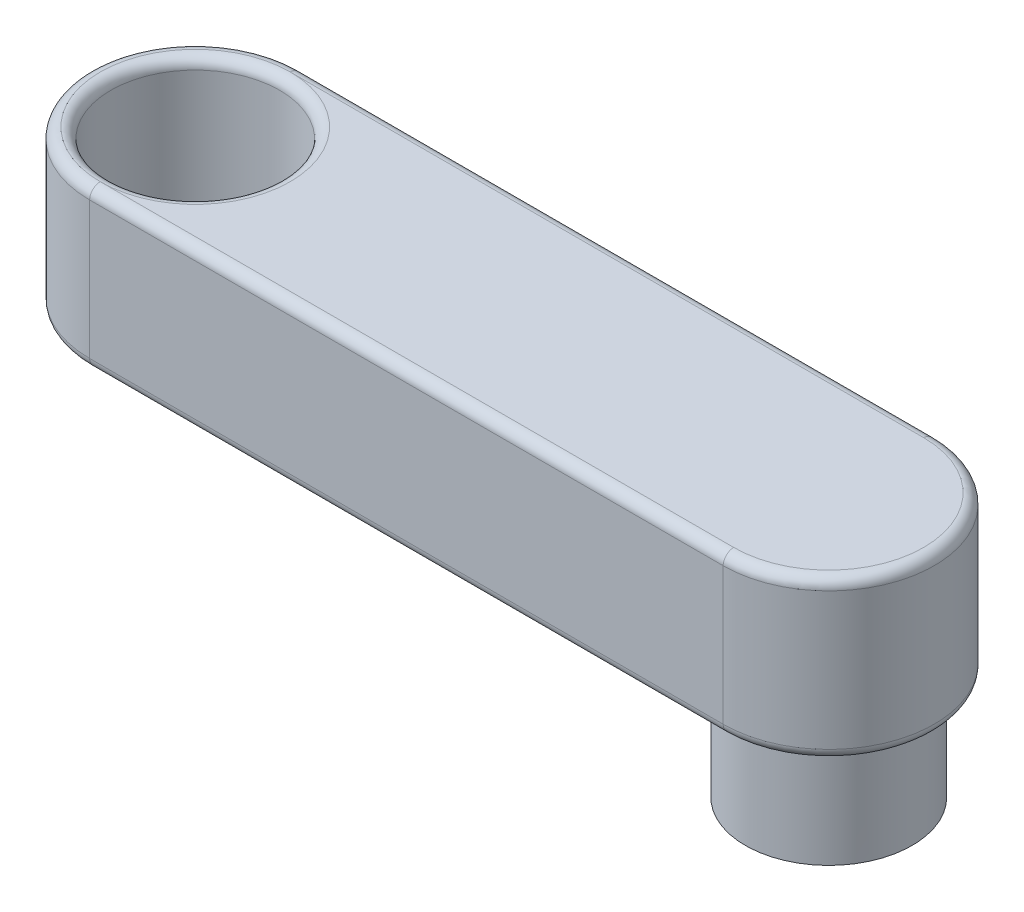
ISO-10303-21;
HEADER;
FILE_DESCRIPTION(('STEP AP214'),'2;1');
FILE_NAME('part.step','',(''),(''),'','','');
FILE_SCHEMA(('AUTOMOTIVE_DESIGN { 1 0 10303 214 1 1 1 1 }'));
ENDSEC;
DATA;
#1=APPLICATION_CONTEXT('core data for automotive mechanical design processes');
#2=APPLICATION_PROTOCOL_DEFINITION('international standard','automotive_design',2000,#1);
#3=PRODUCT_CONTEXT('',#1,'mechanical');
#4=PRODUCT('Part','Part','',(#3));
#5=PRODUCT_RELATED_PRODUCT_CATEGORY('part','',(#4));
#6=PRODUCT_DEFINITION_FORMATION('','',#4);
#7=PRODUCT_DEFINITION_CONTEXT('part definition',#1,'design');
#8=PRODUCT_DEFINITION('design','',#6,#7);
#9=PRODUCT_DEFINITION_SHAPE('','',#8);
#10=(LENGTH_UNIT() NAMED_UNIT(*) SI_UNIT(.MILLI.,.METRE.));
#11=(NAMED_UNIT(*) PLANE_ANGLE_UNIT() SI_UNIT($,.RADIAN.));
#12=(NAMED_UNIT(*) SI_UNIT($,.STERADIAN.) SOLID_ANGLE_UNIT());
#13=UNCERTAINTY_MEASURE_WITH_UNIT(LENGTH_MEASURE(1.E-05),#10,'distance_accuracy_value','');
#14=(GEOMETRIC_REPRESENTATION_CONTEXT(3) GLOBAL_UNCERTAINTY_ASSIGNED_CONTEXT((#13)) GLOBAL_UNIT_ASSIGNED_CONTEXT((#10,
#11,#12)) REPRESENTATION_CONTEXT('',''));
#15=CARTESIAN_POINT('',(0.,0.,0.));
#16=DIRECTION('',(0.,0.,1.));
#17=DIRECTION('',(1.,0.,0.));
#18=AXIS2_PLACEMENT_3D('',#15,#16,#17);
#19=CARTESIAN_POINT('',(-14.7809987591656,-95.551951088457,125.));
#20=DIRECTION('',(0.,1.,0.));
#21=DIRECTION('',(-1.,0.,0.));
#22=AXIS2_PLACEMENT_3D('',#19,#20,#21);
#23=CYLINDRICAL_SURFACE('',#22,50.);
#24=DIRECTION('',(0.,1.,0.));
#25=VECTOR('',#24,1.);
#26=CARTESIAN_POINT('',(-14.7809987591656,-95.5519510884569,75.0000000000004));
#27=LINE('',#26,#25);
#28=CARTESIAN_POINT('',(-14.7809987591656,-90.5519510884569,75.0000000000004));
#29=VERTEX_POINT('',#28);
#30=CARTESIAN_POINT('',(-14.7809987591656,-25.551951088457,75.0000000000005));
#31=VERTEX_POINT('',#30);
#32=EDGE_CURVE('E120',#29,#31,#27,.T.);
#33=ORIENTED_EDGE('',*,*,#32,.F.);
#34=CARTESIAN_POINT('',(-14.7809987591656,-90.551951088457,125.));
#35=DIRECTION('',(0.,-1.,0.));
#36=DIRECTION('',(0.,0.,-1.));
#37=AXIS2_PLACEMENT_3D('',#34,#35,#36);
#38=CIRCLE('',#37,50.);
#39=CARTESIAN_POINT('',(-14.7809987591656,-90.5519510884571,175.));
#40=VERTEX_POINT('',#39);
#41=EDGE_CURVE('E216',#29,#40,#38,.F.);
#42=ORIENTED_EDGE('',*,*,#41,.T.);
#43=DIRECTION('',(0.,1.,0.));
#44=VECTOR('',#43,1.);
#45=CARTESIAN_POINT('',(-14.7809987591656,-95.5519510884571,175.));
#46=LINE('',#45,#44);
#47=CARTESIAN_POINT('',(-14.7809987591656,-25.5519510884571,175.000000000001));
#48=VERTEX_POINT('',#47);
#49=EDGE_CURVE('E253',#40,#48,#46,.T.);
#50=ORIENTED_EDGE('',*,*,#49,.T.);
#51=CARTESIAN_POINT('',(-14.7809987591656,-25.551951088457,125.000000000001));
#52=DIRECTION('',(0.,-1.,0.));
#53=DIRECTION('',(0.,0.,-1.));
#54=AXIS2_PLACEMENT_3D('',#51,#52,#53);
#55=CIRCLE('',#54,50.);
#56=EDGE_CURVE('E168',#48,#31,#55,.T.);
#57=ORIENTED_EDGE('',*,*,#56,.T.);
#58=EDGE_LOOP('',(#33,#42,#50,#57));
#59=FACE_BOUND('',#58,.T.);
#60=ADVANCED_FACE('F39',(#59),#23,.T.);
#61=CARTESIAN_POINT('',(-14.7809987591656,-95.5519510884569,75.0000000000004));
#62=DIRECTION('',(0.,0.,1.));
#63=DIRECTION('',(0.,-1.,0.));
#64=AXIS2_PLACEMENT_3D('',#61,#62,#63);
#65=PLANE('',#64);
#66=DIRECTION('',(0.,1.,0.));
#67=VECTOR('',#66,1.);
#68=CARTESIAN_POINT('',(285.219001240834,-95.5519510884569,75.0000000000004));
#69=LINE('',#68,#67);
#70=CARTESIAN_POINT('',(285.219001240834,-90.5519510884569,75.0000000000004));
#71=VERTEX_POINT('',#70);
#72=CARTESIAN_POINT('',(285.219001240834,-25.551951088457,75.0000000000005));
#73=VERTEX_POINT('',#72);
#74=EDGE_CURVE('E112',#71,#73,#69,.T.);
#75=ORIENTED_EDGE('',*,*,#74,.F.);
#76=DIRECTION('',(1.,0.,0.));
#77=VECTOR('',#76,1.);
#78=CARTESIAN_POINT('',(-14.7809987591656,-90.5519510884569,75.0000000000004));
#79=LINE('',#78,#77);
#80=EDGE_CURVE('E57',#71,#29,#79,.F.);
#81=ORIENTED_EDGE('',*,*,#80,.T.);
#82=ORIENTED_EDGE('',*,*,#32,.T.);
#83=DIRECTION('',(1.,0.,0.));
#84=VECTOR('',#83,1.);
#85=CARTESIAN_POINT('',(-14.7809987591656,-25.5519510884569,75.0000000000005));
#86=LINE('',#85,#84);
#87=EDGE_CURVE('E129',#31,#73,#86,.T.);
#88=ORIENTED_EDGE('',*,*,#87,.T.);
#89=EDGE_LOOP('',(#75,#81,#82,#88));
#90=FACE_BOUND('',#89,.T.);
#91=ADVANCED_FACE('F144',(#90),#65,.F.);
#92=CARTESIAN_POINT('',(285.219001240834,-95.551951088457,125.));
#93=DIRECTION('',(0.,1.,0.));
#94=DIRECTION('',(-1.,0.,0.));
#95=AXIS2_PLACEMENT_3D('',#92,#93,#94);
#96=CYLINDRICAL_SURFACE('',#95,50.);
#97=DIRECTION('',(0.,1.,0.));
#98=VECTOR('',#97,1.);
#99=CARTESIAN_POINT('',(285.219001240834,-95.5519510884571,175.));
#100=LINE('',#99,#98);
#101=CARTESIAN_POINT('',(285.219001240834,-90.5519510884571,175.));
#102=VERTEX_POINT('',#101);
#103=CARTESIAN_POINT('',(285.219001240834,-25.5519510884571,175.000000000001));
#104=VERTEX_POINT('',#103);
#105=EDGE_CURVE('E121',#102,#104,#100,.T.);
#106=ORIENTED_EDGE('',*,*,#105,.F.);
#107=CARTESIAN_POINT('',(285.219001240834,-90.551951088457,125.));
#108=DIRECTION('',(0.,-1.,0.));
#109=DIRECTION('',(0.,0.,-1.));
#110=AXIS2_PLACEMENT_3D('',#107,#108,#109);
#111=CIRCLE('',#110,50.);
#112=EDGE_CURVE('E65',#102,#71,#111,.F.);
#113=ORIENTED_EDGE('',*,*,#112,.T.);
#114=ORIENTED_EDGE('',*,*,#74,.T.);
#115=CARTESIAN_POINT('',(285.219001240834,-25.551951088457,125.000000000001));
#116=DIRECTION('',(0.,-1.,0.));
#117=DIRECTION('',(0.,0.,-1.));
#118=AXIS2_PLACEMENT_3D('',#115,#116,#117);
#119=CIRCLE('',#118,50.);
#120=EDGE_CURVE('E116',#73,#104,#119,.T.);
#121=ORIENTED_EDGE('',*,*,#120,.T.);
#122=EDGE_LOOP('',(#106,#113,#114,#121));
#123=FACE_BOUND('',#122,.T.);
#124=ADVANCED_FACE('F114',(#123),#96,.T.);
#125=CARTESIAN_POINT('',(-14.7809987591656,-95.5519510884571,175.));
#126=DIRECTION('',(0.,0.,-1.));
#127=DIRECTION('',(0.,1.,0.));
#128=AXIS2_PLACEMENT_3D('',#125,#126,#127);
#129=PLANE('',#128);
#130=ORIENTED_EDGE('',*,*,#49,.F.);
#131=DIRECTION('',(-1.,0.,0.));
#132=VECTOR('',#131,1.);
#133=CARTESIAN_POINT('',(285.219001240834,-90.5519510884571,175.));
#134=LINE('',#133,#132);
#135=EDGE_CURVE('E208',#40,#102,#134,.F.);
#136=ORIENTED_EDGE('',*,*,#135,.T.);
#137=ORIENTED_EDGE('',*,*,#105,.T.);
#138=DIRECTION('',(-1.,0.,0.));
#139=VECTOR('',#138,1.);
#140=CARTESIAN_POINT('',(-14.7809987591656,-25.5519510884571,175.000000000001));
#141=LINE('',#140,#139);
#142=EDGE_CURVE('E142',#104,#48,#141,.T.);
#143=ORIENTED_EDGE('',*,*,#142,.T.);
#144=EDGE_LOOP('',(#130,#136,#137,#143));
#145=FACE_BOUND('',#144,.T.);
#146=ADVANCED_FACE('F256',(#145),#129,.F.);
#147=CARTESIAN_POINT('',(-14.7809987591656,-95.551951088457,125.));
#148=DIRECTION('',(0.,-1.,0.));
#149=DIRECTION('',(1.,0.,0.));
#150=AXIS2_PLACEMENT_3D('',#147,#148,#149);
#151=PLANE('',#150);
#152=CARTESIAN_POINT('',(285.219001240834,-95.551951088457,125.));
#153=DIRECTION('',(0.,-1.,0.));
#154=DIRECTION('',(0.,0.,-1.));
#155=AXIS2_PLACEMENT_3D('',#152,#153,#154);
#156=CIRCLE('',#155,45.);
#157=CARTESIAN_POINT('',(285.219001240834,-95.5519510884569,80.0000000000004));
#158=VERTEX_POINT('',#157);
#159=CARTESIAN_POINT('',(285.219001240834,-95.5519510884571,170.));
#160=VERTEX_POINT('',#159);
#161=EDGE_CURVE('E201',#158,#160,#156,.T.);
#162=ORIENTED_EDGE('',*,*,#161,.T.);
#163=DIRECTION('',(-1.,0.,0.));
#164=VECTOR('',#163,1.);
#165=CARTESIAN_POINT('',(-14.7809987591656,-95.5519510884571,170.));
#166=LINE('',#165,#164);
#167=CARTESIAN_POINT('',(-14.7809987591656,-95.5519510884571,170.));
#168=VERTEX_POINT('',#167);
#169=EDGE_CURVE('E204',#160,#168,#166,.T.);
#170=ORIENTED_EDGE('',*,*,#169,.T.);
#171=CARTESIAN_POINT('',(-14.7809987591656,-95.551951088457,125.));
#172=DIRECTION('',(0.,-1.,0.));
#173=DIRECTION('',(0.,0.,-1.));
#174=AXIS2_PLACEMENT_3D('',#171,#172,#173);
#175=CIRCLE('',#174,45.);
#176=CARTESIAN_POINT('',(30.2190012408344,-95.551951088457,125.));
#177=VERTEX_POINT('',#176);
#178=EDGE_CURVE('E192',#168,#177,#175,.F.);
#179=ORIENTED_EDGE('',*,*,#178,.T.);
#180=CARTESIAN_POINT('',(-14.7809987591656,-95.551951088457,125.));
#181=DIRECTION('',(0.,-1.,0.));
#182=DIRECTION('',(0.,0.,-1.));
#183=AXIS2_PLACEMENT_3D('',#180,#181,#182);
#184=CIRCLE('',#183,45.);
#185=CARTESIAN_POINT('',(-14.7809987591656,-95.5519510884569,80.0000000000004));
#186=VERTEX_POINT('',#185);
#187=EDGE_CURVE('E195',#177,#186,#184,.F.);
#188=ORIENTED_EDGE('',*,*,#187,.T.);
#189=DIRECTION('',(1.,0.,0.));
#190=VECTOR('',#189,1.);
#191=CARTESIAN_POINT('',(285.219001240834,-95.5519510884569,80.0000000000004));
#192=LINE('',#191,#190);
#193=EDGE_CURVE('E198',#186,#158,#192,.T.);
#194=ORIENTED_EDGE('',*,*,#193,.T.);
#195=EDGE_LOOP('',(#162,#170,#179,#188,#194));
#196=FACE_BOUND('',#195,.T.);
#197=CARTESIAN_POINT('',(285.219001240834,-95.551951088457,125.));
#198=DIRECTION('',(0.,-1.,0.));
#199=DIRECTION('',(0.,0.,-1.));
#200=AXIS2_PLACEMENT_3D('',#197,#198,#199);
#201=CIRCLE('',#200,44.5);
#202=CARTESIAN_POINT('',(285.219001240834,-95.5519510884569,80.5000000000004));
#203=VERTEX_POINT('',#202);
#204=EDGE_CURVE('E174',#203,#203,#201,.F.);
#205=ORIENTED_EDGE('',*,*,#204,.T.);
#206=EDGE_LOOP('',(#205));
#207=FACE_BOUND('',#206,.T.);
#208=ADVANCED_FACE('F264',(#196,#207),#151,.T.);
#209=CARTESIAN_POINT('',(-14.7809987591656,-20.551951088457,125.000000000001));
#210=DIRECTION('',(0.,-1.,0.));
#211=DIRECTION('',(1.,0.,0.));
#212=AXIS2_PLACEMENT_3D('',#209,#210,#211);
#213=PLANE('',#212);
#214=CARTESIAN_POINT('',(285.219001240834,-20.551951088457,125.000000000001));
#215=DIRECTION('',(0.,-1.,0.));
#216=DIRECTION('',(0.,0.,-1.));
#217=AXIS2_PLACEMENT_3D('',#214,#215,#216);
#218=CIRCLE('',#217,45.);
#219=CARTESIAN_POINT('',(285.219001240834,-20.5519510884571,170.000000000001));
#220=VERTEX_POINT('',#219);
#221=CARTESIAN_POINT('',(285.219001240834,-20.5519510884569,80.0000000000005));
#222=VERTEX_POINT('',#221);
#223=EDGE_CURVE('E160',#220,#222,#218,.F.);
#224=ORIENTED_EDGE('',*,*,#223,.T.);
#225=DIRECTION('',(1.,0.,0.));
#226=VECTOR('',#225,1.);
#227=CARTESIAN_POINT('',(-14.7809987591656,-20.5519510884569,80.0000000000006));
#228=LINE('',#227,#226);
#229=CARTESIAN_POINT('',(-14.7809987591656,-20.5519510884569,80.0000000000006));
#230=VERTEX_POINT('',#229);
#231=EDGE_CURVE('E131',#222,#230,#228,.F.);
#232=ORIENTED_EDGE('',*,*,#231,.T.);
#233=CARTESIAN_POINT('',(-14.7809987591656,-20.551951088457,125.000000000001));
#234=DIRECTION('',(0.,-1.,0.));
#235=DIRECTION('',(0.,0.,-1.));
#236=AXIS2_PLACEMENT_3D('',#233,#234,#235);
#237=CIRCLE('',#236,45.);
#238=CARTESIAN_POINT('',(30.2190012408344,-20.551951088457,125.000000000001));
#239=VERTEX_POINT('',#238);
#240=EDGE_CURVE('E147',#230,#239,#237,.T.);
#241=ORIENTED_EDGE('',*,*,#240,.T.);
#242=CARTESIAN_POINT('',(-14.7809987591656,-20.551951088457,125.000000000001));
#243=DIRECTION('',(0.,-1.,0.));
#244=DIRECTION('',(0.,0.,-1.));
#245=AXIS2_PLACEMENT_3D('',#242,#243,#244);
#246=CIRCLE('',#245,45.);
#247=CARTESIAN_POINT('',(-14.7809987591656,-20.5519510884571,170.000000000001));
#248=VERTEX_POINT('',#247);
#249=EDGE_CURVE('E151',#239,#248,#246,.T.);
#250=ORIENTED_EDGE('',*,*,#249,.T.);
#251=DIRECTION('',(-1.,0.,0.));
#252=VECTOR('',#251,1.);
#253=CARTESIAN_POINT('',(-14.7809987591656,-20.5519510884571,170.000000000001));
#254=LINE('',#253,#252);
#255=EDGE_CURVE('E157',#248,#220,#254,.F.);
#256=ORIENTED_EDGE('',*,*,#255,.T.);
#257=EDGE_LOOP('',(#224,#232,#241,#250,#256));
#258=FACE_BOUND('',#257,.T.);
#259=ADVANCED_FACE('F402',(#258),#213,.F.);
#260=CARTESIAN_POINT('',(-14.7809987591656,-120.551951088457,125.));
#261=DIRECTION('',(0.,1.,0.));
#262=DIRECTION('',(-1.,0.,0.));
#263=AXIS2_PLACEMENT_3D('',#260,#261,#262);
#264=CYLINDRICAL_SURFACE('',#263,40.);
#265=CARTESIAN_POINT('',(-14.7809987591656,-90.551951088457,125.));
#266=DIRECTION('',(0.,-1.,0.));
#267=DIRECTION('',(0.,0.,-1.));
#268=AXIS2_PLACEMENT_3D('',#265,#266,#267);
#269=CIRCLE('',#268,40.);
#270=CARTESIAN_POINT('',(-54.7809987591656,-90.551951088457,125.));
#271=VERTEX_POINT('',#270);
#272=EDGE_CURVE('E49',#271,#271,#269,.T.);
#273=CARTESIAN_POINT('',(-14.7809987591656,-25.551951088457,125.000000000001));
#274=DIRECTION('',(0.,-1.,0.));
#275=DIRECTION('',(0.,0.,-1.));
#276=AXIS2_PLACEMENT_3D('',#273,#274,#275);
#277=CIRCLE('',#276,40.);
#278=CARTESIAN_POINT('',(-54.7809987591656,-25.551951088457,125.000000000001));
#279=VERTEX_POINT('',#278);
#280=EDGE_CURVE('E171',#279,#279,#277,.F.);
#281=CARTESIAN_POINT('',(-54.7809987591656,-90.551951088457,125.));
#282=CARTESIAN_POINT('',(-54.7809987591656,-89.8748677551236,125.));
#283=CARTESIAN_POINT('',(-54.7809987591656,-89.1977844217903,125.));
#284=CARTESIAN_POINT('',(-54.7809987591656,-87.8436177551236,125.));
#285=CARTESIAN_POINT('',(-54.7809987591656,-87.1665344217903,125.));
#286=CARTESIAN_POINT('',(-54.7809987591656,-85.8123677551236,125.));
#287=CARTESIAN_POINT('',(-54.7809987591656,-85.1352844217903,125.));
#288=CARTESIAN_POINT('',(-54.7809987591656,-83.7811177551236,125.));
#289=CARTESIAN_POINT('',(-54.7809987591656,-83.1040344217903,125.));
#290=CARTESIAN_POINT('',(-54.7809987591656,-81.7498677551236,125.));
#291=CARTESIAN_POINT('',(-54.7809987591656,-81.0727844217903,125.));
#292=CARTESIAN_POINT('',(-54.7809987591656,-79.7186177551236,125.));
#293=CARTESIAN_POINT('',(-54.7809987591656,-79.0415344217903,125.));
#294=CARTESIAN_POINT('',(-54.7809987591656,-77.6873677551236,125.));
#295=CARTESIAN_POINT('',(-54.7809987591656,-77.0102844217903,125.));
#296=CARTESIAN_POINT('',(-54.7809987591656,-75.6561177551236,125.));
#297=CARTESIAN_POINT('',(-54.7809987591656,-74.9790344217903,125.));
#298=CARTESIAN_POINT('',(-54.7809987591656,-73.6248677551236,125.));
#299=CARTESIAN_POINT('',(-54.7809987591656,-72.9477844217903,125.));
#300=CARTESIAN_POINT('',(-54.7809987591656,-71.5936177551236,125.));
#301=CARTESIAN_POINT('',(-54.7809987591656,-70.9165344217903,125.));
#302=CARTESIAN_POINT('',(-54.7809987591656,-69.5623677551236,125.));
#303=CARTESIAN_POINT('',(-54.7809987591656,-68.8852844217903,125.));
#304=CARTESIAN_POINT('',(-54.7809987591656,-67.5311177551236,125.));
#305=CARTESIAN_POINT('',(-54.7809987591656,-66.8540344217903,125.));
#306=CARTESIAN_POINT('',(-54.7809987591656,-65.4998677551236,125.));
#307=CARTESIAN_POINT('',(-54.7809987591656,-64.8227844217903,125.));
#308=CARTESIAN_POINT('',(-54.7809987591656,-63.4686177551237,125.));
#309=CARTESIAN_POINT('',(-54.7809987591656,-62.7915344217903,125.));
#310=CARTESIAN_POINT('',(-54.7809987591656,-61.4373677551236,125.));
#311=CARTESIAN_POINT('',(-54.7809987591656,-60.7602844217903,125.));
#312=CARTESIAN_POINT('',(-54.7809987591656,-59.4061177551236,125.));
#313=CARTESIAN_POINT('',(-54.7809987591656,-58.7290344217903,125.));
#314=CARTESIAN_POINT('',(-54.7809987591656,-57.3748677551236,125.));
#315=CARTESIAN_POINT('',(-54.7809987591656,-56.6977844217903,125.));
#316=CARTESIAN_POINT('',(-54.7809987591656,-55.3436177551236,125.));
#317=CARTESIAN_POINT('',(-54.7809987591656,-54.6665344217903,125.));
#318=CARTESIAN_POINT('',(-54.7809987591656,-53.3123677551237,125.));
#319=CARTESIAN_POINT('',(-54.7809987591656,-52.6352844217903,125.));
#320=CARTESIAN_POINT('',(-54.7809987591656,-51.2811177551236,125.));
#321=CARTESIAN_POINT('',(-54.7809987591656,-50.6040344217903,125.));
#322=CARTESIAN_POINT('',(-54.7809987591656,-49.2498677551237,125.));
#323=CARTESIAN_POINT('',(-54.7809987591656,-48.5727844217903,125.));
#324=CARTESIAN_POINT('',(-54.7809987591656,-47.2186177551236,125.));
#325=CARTESIAN_POINT('',(-54.7809987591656,-46.5415344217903,125.));
#326=CARTESIAN_POINT('',(-54.7809987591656,-45.1873677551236,125.));
#327=CARTESIAN_POINT('',(-54.7809987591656,-44.5102844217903,125.000000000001));
#328=CARTESIAN_POINT('',(-54.7809987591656,-43.1561177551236,125.000000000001));
#329=CARTESIAN_POINT('',(-54.7809987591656,-42.4790344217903,125.000000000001));
#330=CARTESIAN_POINT('',(-54.7809987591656,-41.1248677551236,125.000000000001));
#331=CARTESIAN_POINT('',(-54.7809987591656,-40.4477844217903,125.000000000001));
#332=CARTESIAN_POINT('',(-54.7809987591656,-39.0936177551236,125.000000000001));
#333=CARTESIAN_POINT('',(-54.7809987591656,-38.4165344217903,125.000000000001));
#334=CARTESIAN_POINT('',(-54.7809987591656,-37.0623677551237,125.000000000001));
#335=CARTESIAN_POINT('',(-54.7809987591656,-36.3852844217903,125.000000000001));
#336=CARTESIAN_POINT('',(-54.7809987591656,-35.0311177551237,125.000000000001));
#337=CARTESIAN_POINT('',(-54.7809987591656,-34.3540344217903,125.000000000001));
#338=CARTESIAN_POINT('',(-54.7809987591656,-32.9998677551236,125.000000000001));
#339=CARTESIAN_POINT('',(-54.7809987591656,-32.3227844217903,125.000000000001));
#340=CARTESIAN_POINT('',(-54.7809987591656,-30.9686177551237,125.000000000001));
#341=CARTESIAN_POINT('',(-54.7809987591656,-30.2915344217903,125.000000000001));
#342=CARTESIAN_POINT('',(-54.7809987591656,-28.9373677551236,125.000000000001));
#343=CARTESIAN_POINT('',(-54.7809987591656,-28.2602844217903,125.000000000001));
#344=CARTESIAN_POINT('',(-54.7809987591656,-26.9061177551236,125.000000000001));
#345=CARTESIAN_POINT('',(-54.7809987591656,-26.2290344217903,125.000000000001));
#346=CARTESIAN_POINT('',(-54.7809987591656,-25.551951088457,125.000000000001));
#347=B_SPLINE_CURVE_WITH_KNOTS('',3,(#281,#282,#283,#284,#285,#286,#287,#288,#289,#290,#291,
#292,#293,#294,#295,#296,#297,#298,#299,#300,#301,#302,#303,#304,#305,#306,#307,#308,#309,#310,
#311,#312,#313,#314,#315,#316,#317,#318,#319,#320,#321,#322,#323,#324,#325,#326,#327,#328,#329,
#330,#331,#332,#333,#334,#335,#336,#337,#338,#339,#340,#341,#342,#343,#344,#345,#346),
.UNSPECIFIED.,.F.,.F.,(4,2,2,2,2,2,2,2,2,2,2,2,2,2,2,2,2,2,2,2,2,2,2,2,2,2,2,2,2,2,2,2,4),(0.,
2.03125,4.06249999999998,6.09374999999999,8.12499999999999,10.15625,12.1875,14.21875,16.25,
18.28125,20.3125,22.34375,24.375,26.40625,28.4375,30.46875,32.5,34.53125,36.5625,38.59375,
40.625,42.65625,44.6875,46.71875,48.75,50.78125,52.8125,54.84375,56.875,58.90625,60.9375,
62.96875,65.),.UNSPECIFIED.);
#348=EDGE_CURVE('BSEAM407',#271,#279,#347,.T.);
#349=ORIENTED_EDGE('',*,*,#272,.T.);
#350=ORIENTED_EDGE('',*,*,#280,.T.);
#351=ORIENTED_EDGE('',*,*,#348,.T.);
#352=ORIENTED_EDGE('',*,*,#348,.F.);
#353=EDGE_LOOP('',(#349,#351,#350,#352));
#354=FACE_BOUND('',#353,.T.);
#355=ADVANCED_FACE('F407',(#354),#264,.F.);
#356=CARTESIAN_POINT('',(285.219001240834,-145.551951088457,125.));
#357=DIRECTION('',(0.,1.,0.));
#358=DIRECTION('',(-1.,0.,0.));
#359=AXIS2_PLACEMENT_3D('',#356,#357,#358);
#360=CYLINDRICAL_SURFACE('',#359,39.5);
#361=CARTESIAN_POINT('',(285.219001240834,-100.551951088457,125.));
#362=DIRECTION('',(0.,-1.,0.));
#363=DIRECTION('',(0.,0.,-1.));
#364=AXIS2_PLACEMENT_3D('',#361,#362,#363);
#365=CIRCLE('',#364,39.5);
#366=CARTESIAN_POINT('',(245.719001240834,-100.551951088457,125.));
#367=VERTEX_POINT('',#366);
#368=EDGE_CURVE('E11',#367,#367,#365,.T.);
#369=CARTESIAN_POINT('',(285.219001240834,-145.551951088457,125.));
#370=DIRECTION('',(0.,-1.,0.));
#371=DIRECTION('',(1.,0.,0.));
#372=AXIS2_PLACEMENT_3D('',#369,#370,#371);
#373=CIRCLE('',#372,39.5);
#374=CARTESIAN_POINT('',(245.719001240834,-145.551951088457,125.));
#375=VERTEX_POINT('',#374);
#376=EDGE_CURVE('E188',#375,#375,#373,.T.);
#377=CARTESIAN_POINT('',(245.719001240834,-100.551951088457,125.));
#378=CARTESIAN_POINT('',(245.719001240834,-101.020701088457,125.));
#379=CARTESIAN_POINT('',(245.719001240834,-101.489451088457,125.));
#380=CARTESIAN_POINT('',(245.719001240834,-102.426951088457,125.));
#381=CARTESIAN_POINT('',(245.719001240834,-102.895701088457,125.));
#382=CARTESIAN_POINT('',(245.719001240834,-103.833201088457,125.));
#383=CARTESIAN_POINT('',(245.719001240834,-104.301951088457,125.));
#384=CARTESIAN_POINT('',(245.719001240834,-105.239451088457,125.));
#385=CARTESIAN_POINT('',(245.719001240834,-105.708201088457,125.));
#386=CARTESIAN_POINT('',(245.719001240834,-106.645701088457,125.));
#387=CARTESIAN_POINT('',(245.719001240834,-107.114451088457,125.));
#388=CARTESIAN_POINT('',(245.719001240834,-108.051951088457,125.));
#389=CARTESIAN_POINT('',(245.719001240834,-108.520701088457,125.));
#390=CARTESIAN_POINT('',(245.719001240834,-109.458201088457,125.));
#391=CARTESIAN_POINT('',(245.719001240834,-109.926951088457,125.));
#392=CARTESIAN_POINT('',(245.719001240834,-110.864451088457,125.));
#393=CARTESIAN_POINT('',(245.719001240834,-111.333201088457,125.));
#394=CARTESIAN_POINT('',(245.719001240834,-112.270701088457,125.));
#395=CARTESIAN_POINT('',(245.719001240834,-112.739451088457,125.));
#396=CARTESIAN_POINT('',(245.719001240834,-113.676951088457,125.));
#397=CARTESIAN_POINT('',(245.719001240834,-114.145701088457,125.));
#398=CARTESIAN_POINT('',(245.719001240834,-115.083201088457,125.));
#399=CARTESIAN_POINT('',(245.719001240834,-115.551951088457,125.));
#400=CARTESIAN_POINT('',(245.719001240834,-116.489451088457,125.));
#401=CARTESIAN_POINT('',(245.719001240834,-116.958201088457,125.));
#402=CARTESIAN_POINT('',(245.719001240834,-117.895701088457,125.));
#403=CARTESIAN_POINT('',(245.719001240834,-118.364451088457,125.));
#404=CARTESIAN_POINT('',(245.719001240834,-119.301951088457,125.));
#405=CARTESIAN_POINT('',(245.719001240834,-119.770701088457,125.));
#406=CARTESIAN_POINT('',(245.719001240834,-120.708201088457,125.));
#407=CARTESIAN_POINT('',(245.719001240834,-121.176951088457,125.));
#408=CARTESIAN_POINT('',(245.719001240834,-122.114451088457,125.));
#409=CARTESIAN_POINT('',(245.719001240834,-122.583201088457,125.));
#410=CARTESIAN_POINT('',(245.719001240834,-123.520701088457,125.));
#411=CARTESIAN_POINT('',(245.719001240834,-123.989451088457,125.));
#412=CARTESIAN_POINT('',(245.719001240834,-124.926951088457,125.));
#413=CARTESIAN_POINT('',(245.719001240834,-125.395701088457,125.));
#414=CARTESIAN_POINT('',(245.719001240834,-126.333201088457,125.));
#415=CARTESIAN_POINT('',(245.719001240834,-126.801951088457,125.));
#416=CARTESIAN_POINT('',(245.719001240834,-127.739451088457,125.));
#417=CARTESIAN_POINT('',(245.719001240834,-128.208201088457,125.));
#418=CARTESIAN_POINT('',(245.719001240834,-129.145701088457,125.));
#419=CARTESIAN_POINT('',(245.719001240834,-129.614451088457,125.));
#420=CARTESIAN_POINT('',(245.719001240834,-130.551951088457,125.));
#421=CARTESIAN_POINT('',(245.719001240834,-131.020701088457,125.));
#422=CARTESIAN_POINT('',(245.719001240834,-131.958201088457,125.));
#423=CARTESIAN_POINT('',(245.719001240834,-132.426951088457,125.));
#424=CARTESIAN_POINT('',(245.719001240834,-133.364451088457,125.));
#425=CARTESIAN_POINT('',(245.719001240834,-133.833201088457,125.));
#426=CARTESIAN_POINT('',(245.719001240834,-134.770701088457,125.));
#427=CARTESIAN_POINT('',(245.719001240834,-135.239451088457,125.));
#428=CARTESIAN_POINT('',(245.719001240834,-136.176951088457,125.));
#429=CARTESIAN_POINT('',(245.719001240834,-136.645701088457,125.));
#430=CARTESIAN_POINT('',(245.719001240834,-137.583201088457,125.));
#431=CARTESIAN_POINT('',(245.719001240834,-138.051951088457,125.));
#432=CARTESIAN_POINT('',(245.719001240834,-138.989451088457,125.));
#433=CARTESIAN_POINT('',(245.719001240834,-139.458201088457,125.));
#434=CARTESIAN_POINT('',(245.719001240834,-140.395701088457,125.));
#435=CARTESIAN_POINT('',(245.719001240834,-140.864451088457,125.));
#436=CARTESIAN_POINT('',(245.719001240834,-141.801951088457,125.));
#437=CARTESIAN_POINT('',(245.719001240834,-142.270701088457,125.));
#438=CARTESIAN_POINT('',(245.719001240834,-143.208201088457,125.));
#439=CARTESIAN_POINT('',(245.719001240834,-143.676951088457,125.));
#440=CARTESIAN_POINT('',(245.719001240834,-144.614451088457,125.));
#441=CARTESIAN_POINT('',(245.719001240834,-145.083201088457,125.));
#442=CARTESIAN_POINT('',(245.719001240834,-145.551951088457,125.));
#443=B_SPLINE_CURVE_WITH_KNOTS('',3,(#377,#378,#379,#380,#381,#382,#383,#384,#385,#386,#387,
#388,#389,#390,#391,#392,#393,#394,#395,#396,#397,#398,#399,#400,#401,#402,#403,#404,#405,#406,
#407,#408,#409,#410,#411,#412,#413,#414,#415,#416,#417,#418,#419,#420,#421,#422,#423,#424,#425,
#426,#427,#428,#429,#430,#431,#432,#433,#434,#435,#436,#437,#438,#439,#440,#441,#442),
.UNSPECIFIED.,.F.,.F.,(4,2,2,2,2,2,2,2,2,2,2,2,2,2,2,2,2,2,2,2,2,2,2,2,2,2,2,2,2,2,2,2,4),(0.,
1.40625,2.8125,4.21874999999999,5.62499999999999,7.03124999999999,8.43749999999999,
9.84374999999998,11.25,12.65625,14.0625,15.46875,16.875,18.28125,19.6875,21.09375,22.5,23.90625,
25.3125,26.71875,28.125,29.53125,30.9375,32.34375,33.75,35.15625,36.5625,37.96875,39.375,
40.78125,42.1875,43.59375,45.),.UNSPECIFIED.);
#444=EDGE_CURVE('BSEAM375',#367,#375,#443,.T.);
#445=ORIENTED_EDGE('',*,*,#368,.T.);
#446=ORIENTED_EDGE('',*,*,#376,.F.);
#447=ORIENTED_EDGE('',*,*,#444,.T.);
#448=ORIENTED_EDGE('',*,*,#444,.F.);
#449=EDGE_LOOP('',(#445,#447,#446,#448));
#450=FACE_BOUND('',#449,.T.);
#451=ADVANCED_FACE('F375',(#450),#360,.T.);
#452=CARTESIAN_POINT('',(285.219001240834,-145.551951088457,125.));
#453=DIRECTION('',(0.,-1.,0.));
#454=DIRECTION('',(1.,0.,0.));
#455=AXIS2_PLACEMENT_3D('',#452,#453,#454);
#456=PLANE('',#455);
#457=ORIENTED_EDGE('',*,*,#376,.T.);
#458=EDGE_LOOP('',(#457));
#459=FACE_BOUND('',#458,.T.);
#460=ADVANCED_FACE('F299',(#459),#456,.T.);
#461=CARTESIAN_POINT('',(-14.7809987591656,-25.551951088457,125.000000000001));
#462=DIRECTION('',(0.,-1.,0.));
#463=DIRECTION('',(0.,0.,-1.));
#464=AXIS2_PLACEMENT_3D('',#461,#462,#463);
#465=TOROIDAL_SURFACE('',#464,45.,5.);
#466=ORIENTED_EDGE('',*,*,#280,.F.);
#467=EDGE_LOOP('',(#466));
#468=FACE_BOUND('',#467,.T.);
#469=ORIENTED_EDGE('',*,*,#249,.F.);
#470=ORIENTED_EDGE('',*,*,#240,.F.);
#471=CARTESIAN_POINT('',(-14.7809987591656,-20.551951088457,125.000000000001));
#472=DIRECTION('',(0.,-1.,0.));
#473=DIRECTION('',(0.,0.,-1.));
#474=AXIS2_PLACEMENT_3D('',#471,#472,#473);
#475=CIRCLE('',#474,45.);
#476=EDGE_CURVE('E184',#248,#230,#475,.T.);
#477=ORIENTED_EDGE('',*,*,#476,.F.);
#478=EDGE_LOOP('',(#469,#470,#477));
#479=FACE_BOUND('',#478,.T.);
#480=ADVANCED_FACE('F295',(#468,#479),#465,.T.);
#481=CARTESIAN_POINT('',(-14.7809987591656,-25.5519510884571,170.000000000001));
#482=DIRECTION('',(-1.,0.,0.));
#483=DIRECTION('',(0.,0.,1.));
#484=AXIS2_PLACEMENT_3D('',#481,#482,#483);
#485=CYLINDRICAL_SURFACE('',#484,5.);
#486=CARTESIAN_POINT('',(285.219001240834,-25.5519510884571,170.000000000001));
#487=DIRECTION('',(1.,0.,0.));
#488=DIRECTION('',(0.,0.,-1.));
#489=AXIS2_PLACEMENT_3D('',#486,#487,#488);
#490=CIRCLE('',#489,5.);
#491=EDGE_CURVE('E140',#220,#104,#490,.T.);
#492=ORIENTED_EDGE('',*,*,#491,.F.);
#493=ORIENTED_EDGE('',*,*,#255,.F.);
#494=CARTESIAN_POINT('',(-14.7809987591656,-25.5519510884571,170.000000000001));
#495=DIRECTION('',(-1.,0.,0.));
#496=DIRECTION('',(0.,0.,1.));
#497=AXIS2_PLACEMENT_3D('',#494,#495,#496);
#498=CIRCLE('',#497,5.);
#499=EDGE_CURVE('E180',#48,#248,#498,.T.);
#500=ORIENTED_EDGE('',*,*,#499,.F.);
#501=ORIENTED_EDGE('',*,*,#142,.F.);
#502=EDGE_LOOP('',(#492,#493,#500,#501));
#503=FACE_BOUND('',#502,.T.);
#504=ADVANCED_FACE('F291',(#503),#485,.T.);
#505=CARTESIAN_POINT('',(-14.7809987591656,-25.551951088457,125.000000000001));
#506=DIRECTION('',(0.,-1.,0.));
#507=DIRECTION('',(0.,0.,-1.));
#508=AXIS2_PLACEMENT_3D('',#505,#506,#507);
#509=TOROIDAL_SURFACE('',#508,45.,5.);
#510=ORIENTED_EDGE('',*,*,#499,.T.);
#511=ORIENTED_EDGE('',*,*,#476,.T.);
#512=CARTESIAN_POINT('',(-14.7809987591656,-25.5519510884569,80.0000000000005));
#513=DIRECTION('',(1.,0.,0.));
#514=DIRECTION('',(0.,0.,-1.));
#515=AXIS2_PLACEMENT_3D('',#512,#513,#514);
#516=CIRCLE('',#515,5.);
#517=EDGE_CURVE('E135',#31,#230,#516,.T.);
#518=ORIENTED_EDGE('',*,*,#517,.F.);
#519=ORIENTED_EDGE('',*,*,#56,.F.);
#520=EDGE_LOOP('',(#510,#511,#518,#519));
#521=FACE_BOUND('',#520,.T.);
#522=ADVANCED_FACE('F288',(#521),#509,.T.);
#523=CARTESIAN_POINT('',(285.219001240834,-25.551951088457,125.000000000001));
#524=DIRECTION('',(0.,-1.,0.));
#525=DIRECTION('',(0.,0.,-1.));
#526=AXIS2_PLACEMENT_3D('',#523,#524,#525);
#527=TOROIDAL_SURFACE('',#526,45.,5.);
#528=ORIENTED_EDGE('',*,*,#491,.T.);
#529=ORIENTED_EDGE('',*,*,#120,.F.);
#530=CARTESIAN_POINT('',(285.219001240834,-25.5519510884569,80.0000000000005));
#531=DIRECTION('',(-1.,0.,0.));
#532=DIRECTION('',(0.,0.,1.));
#533=AXIS2_PLACEMENT_3D('',#530,#531,#532);
#534=CIRCLE('',#533,5.);
#535=EDGE_CURVE('E127',#222,#73,#534,.T.);
#536=ORIENTED_EDGE('',*,*,#535,.F.);
#537=ORIENTED_EDGE('',*,*,#223,.F.);
#538=EDGE_LOOP('',(#528,#529,#536,#537));
#539=FACE_BOUND('',#538,.T.);
#540=ADVANCED_FACE('F138',(#539),#527,.T.);
#541=CARTESIAN_POINT('',(-14.7809987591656,-25.5519510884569,80.0000000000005));
#542=DIRECTION('',(1.,0.,0.));
#543=DIRECTION('',(0.,0.,-1.));
#544=AXIS2_PLACEMENT_3D('',#541,#542,#543);
#545=CYLINDRICAL_SURFACE('',#544,5.);
#546=ORIENTED_EDGE('',*,*,#517,.T.);
#547=ORIENTED_EDGE('',*,*,#231,.F.);
#548=ORIENTED_EDGE('',*,*,#535,.T.);
#549=ORIENTED_EDGE('',*,*,#87,.F.);
#550=EDGE_LOOP('',(#546,#547,#548,#549));
#551=FACE_BOUND('',#550,.T.);
#552=ADVANCED_FACE('F128',(#551),#545,.T.);
#553=CARTESIAN_POINT('',(-14.7809987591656,-90.551951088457,125.));
#554=DIRECTION('',(0.,-1.,0.));
#555=DIRECTION('',(0.,0.,-1.));
#556=AXIS2_PLACEMENT_3D('',#553,#554,#555);
#557=TOROIDAL_SURFACE('',#556,45.,5.);
#558=ORIENTED_EDGE('',*,*,#272,.F.);
#559=EDGE_LOOP('',(#558));
#560=FACE_BOUND('',#559,.T.);
#561=ORIENTED_EDGE('',*,*,#187,.F.);
#562=ORIENTED_EDGE('',*,*,#178,.F.);
#563=CARTESIAN_POINT('',(-14.7809987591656,-95.551951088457,125.));
#564=DIRECTION('',(0.,-1.,0.));
#565=DIRECTION('',(0.,0.,-1.));
#566=AXIS2_PLACEMENT_3D('',#563,#564,#565);
#567=CIRCLE('',#566,45.);
#568=EDGE_CURVE('E231',#186,#168,#567,.F.);
#569=ORIENTED_EDGE('',*,*,#568,.F.);
#570=EDGE_LOOP('',(#561,#562,#569));
#571=FACE_BOUND('',#570,.T.);
#572=ADVANCED_FACE('F268',(#560,#571),#557,.T.);
#573=CARTESIAN_POINT('',(-14.7809987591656,-90.5519510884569,80.0000000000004));
#574=DIRECTION('',(-1.,0.,0.));
#575=DIRECTION('',(0.,0.,1.));
#576=AXIS2_PLACEMENT_3D('',#573,#574,#575);
#577=CYLINDRICAL_SURFACE('',#576,5.);
#578=CARTESIAN_POINT('',(-14.7809987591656,-90.5519510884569,80.0000000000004));
#579=DIRECTION('',(-1.,0.,0.));
#580=DIRECTION('',(0.,0.,1.));
#581=AXIS2_PLACEMENT_3D('',#578,#579,#580);
#582=CIRCLE('',#581,5.);
#583=EDGE_CURVE('E228',#29,#186,#582,.T.);
#584=ORIENTED_EDGE('',*,*,#583,.F.);
#585=ORIENTED_EDGE('',*,*,#80,.F.);
#586=CARTESIAN_POINT('',(285.219001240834,-90.5519510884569,80.0000000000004));
#587=DIRECTION('',(1.,0.,0.));
#588=DIRECTION('',(0.,0.,-1.));
#589=AXIS2_PLACEMENT_3D('',#586,#587,#588);
#590=CIRCLE('',#589,5.);
#591=EDGE_CURVE('E43',#158,#71,#590,.T.);
#592=ORIENTED_EDGE('',*,*,#591,.F.);
#593=ORIENTED_EDGE('',*,*,#193,.F.);
#594=EDGE_LOOP('',(#584,#585,#592,#593));
#595=FACE_BOUND('',#594,.T.);
#596=ADVANCED_FACE('F248',(#595),#577,.T.);
#597=CARTESIAN_POINT('',(285.219001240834,-90.551951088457,125.));
#598=DIRECTION('',(0.,-1.,0.));
#599=DIRECTION('',(0.,0.,-1.));
#600=AXIS2_PLACEMENT_3D('',#597,#598,#599);
#601=TOROIDAL_SURFACE('',#600,45.,5.);
#602=ORIENTED_EDGE('',*,*,#591,.T.);
#603=ORIENTED_EDGE('',*,*,#112,.F.);
#604=CARTESIAN_POINT('',(285.219001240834,-90.5519510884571,170.));
#605=DIRECTION('',(-1.,0.,0.));
#606=DIRECTION('',(0.,0.,1.));
#607=AXIS2_PLACEMENT_3D('',#604,#605,#606);
#608=CIRCLE('',#607,5.);
#609=EDGE_CURVE('E225',#160,#102,#608,.T.);
#610=ORIENTED_EDGE('',*,*,#609,.F.);
#611=ORIENTED_EDGE('',*,*,#161,.F.);
#612=EDGE_LOOP('',(#602,#603,#610,#611));
#613=FACE_BOUND('',#612,.T.);
#614=ADVANCED_FACE('F243',(#613),#601,.T.);
#615=CARTESIAN_POINT('',(-14.7809987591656,-90.551951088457,125.));
#616=DIRECTION('',(0.,-1.,0.));
#617=DIRECTION('',(0.,0.,-1.));
#618=AXIS2_PLACEMENT_3D('',#615,#616,#617);
#619=TOROIDAL_SURFACE('',#618,45.,5.);
#620=ORIENTED_EDGE('',*,*,#583,.T.);
#621=ORIENTED_EDGE('',*,*,#568,.T.);
#622=CARTESIAN_POINT('',(-14.7809987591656,-90.5519510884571,170.));
#623=DIRECTION('',(1.,0.,0.));
#624=DIRECTION('',(0.,0.,-1.));
#625=AXIS2_PLACEMENT_3D('',#622,#623,#624);
#626=CIRCLE('',#625,5.);
#627=EDGE_CURVE('E222',#40,#168,#626,.T.);
#628=ORIENTED_EDGE('',*,*,#627,.F.);
#629=ORIENTED_EDGE('',*,*,#41,.F.);
#630=EDGE_LOOP('',(#620,#621,#628,#629));
#631=FACE_BOUND('',#630,.T.);
#632=ADVANCED_FACE('F250',(#631),#619,.T.);
#633=CARTESIAN_POINT('',(-14.7809987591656,-90.5519510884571,170.));
#634=DIRECTION('',(1.,0.,0.));
#635=DIRECTION('',(0.,0.,-1.));
#636=AXIS2_PLACEMENT_3D('',#633,#634,#635);
#637=CYLINDRICAL_SURFACE('',#636,5.);
#638=ORIENTED_EDGE('',*,*,#609,.T.);
#639=ORIENTED_EDGE('',*,*,#135,.F.);
#640=ORIENTED_EDGE('',*,*,#627,.T.);
#641=ORIENTED_EDGE('',*,*,#169,.F.);
#642=EDGE_LOOP('',(#638,#639,#640,#641));
#643=FACE_BOUND('',#642,.T.);
#644=ADVANCED_FACE('F261',(#643),#637,.T.);
#645=CARTESIAN_POINT('',(285.219001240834,-100.551951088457,125.));
#646=DIRECTION('',(0.,-1.,0.));
#647=DIRECTION('',(0.,0.,-1.));
#648=AXIS2_PLACEMENT_3D('',#645,#646,#647);
#649=TOROIDAL_SURFACE('',#648,44.5,5.);
#650=ORIENTED_EDGE('',*,*,#204,.F.);
#651=EDGE_LOOP('',(#650));
#652=FACE_BOUND('',#651,.T.);
#653=ORIENTED_EDGE('',*,*,#368,.F.);
#654=EDGE_LOOP('',(#653));
#655=FACE_BOUND('',#654,.T.);
#656=ADVANCED_FACE('F41',(#652,#655),#649,.F.);
#657=CLOSED_SHELL('',(#60,#91,#124,#146,#208,#259,#355,#451,#460,#480,#504,#522,#540,#552,#572,
#596,#614,#632,#644,#656));
#658=MANIFOLD_SOLID_BREP('B2',#657);
#659=ADVANCED_BREP_SHAPE_REPRESENTATION('',(#18,#658),#14);
#660=SHAPE_DEFINITION_REPRESENTATION(#9,#659);
ENDSEC;
END-ISO-10303-21;
